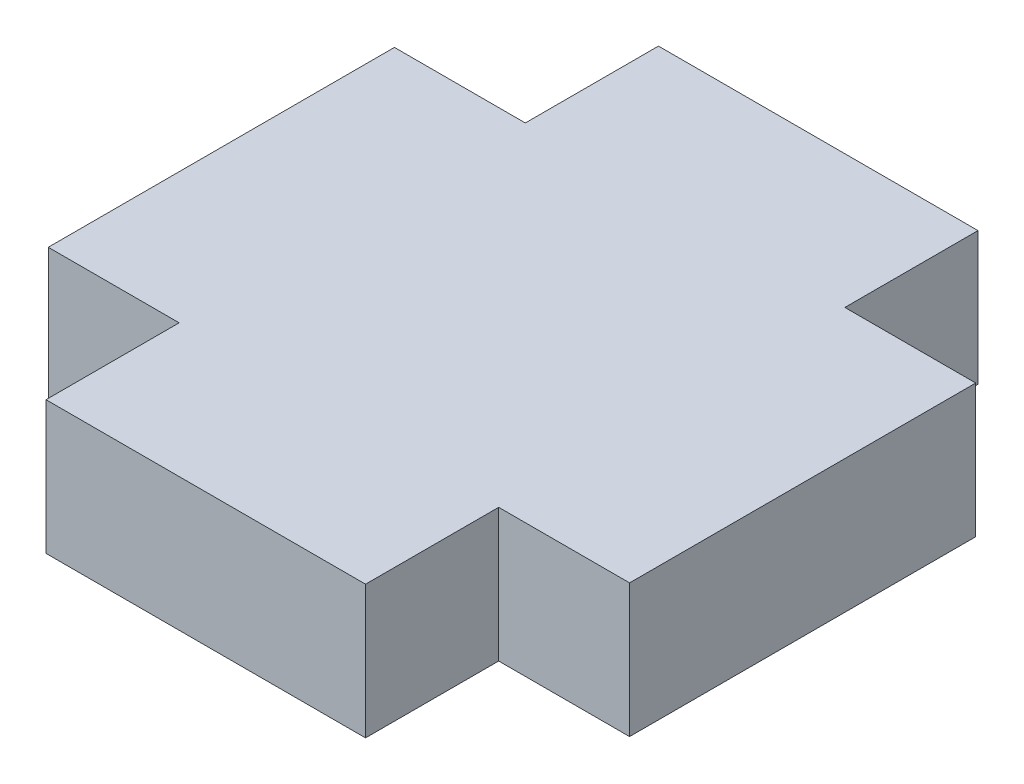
ISO-10303-21;
HEADER;
FILE_DESCRIPTION(('STEP AP214'),'2;1');
FILE_NAME('part.step','',(''),(''),'','','');
FILE_SCHEMA(('AUTOMOTIVE_DESIGN { 1 0 10303 214 1 1 1 1 }'));
ENDSEC;
DATA;
#1=APPLICATION_CONTEXT('core data for automotive mechanical design processes');
#2=APPLICATION_PROTOCOL_DEFINITION('international standard','automotive_design',2000,#1);
#3=PRODUCT_CONTEXT('',#1,'mechanical');
#4=PRODUCT('Part','Part','',(#3));
#5=PRODUCT_RELATED_PRODUCT_CATEGORY('part','',(#4));
#6=PRODUCT_DEFINITION_FORMATION('','',#4);
#7=PRODUCT_DEFINITION_CONTEXT('part definition',#1,'design');
#8=PRODUCT_DEFINITION('design','',#6,#7);
#9=PRODUCT_DEFINITION_SHAPE('','',#8);
#10=(LENGTH_UNIT() NAMED_UNIT(*) SI_UNIT(.MILLI.,.METRE.));
#11=(NAMED_UNIT(*) PLANE_ANGLE_UNIT() SI_UNIT($,.RADIAN.));
#12=(NAMED_UNIT(*) SI_UNIT($,.STERADIAN.) SOLID_ANGLE_UNIT());
#13=UNCERTAINTY_MEASURE_WITH_UNIT(LENGTH_MEASURE(1.E-05),#10,'distance_accuracy_value','');
#14=(GEOMETRIC_REPRESENTATION_CONTEXT(3) GLOBAL_UNCERTAINTY_ASSIGNED_CONTEXT((#13)) GLOBAL_UNIT_ASSIGNED_CONTEXT((#10,
#11,#12)) REPRESENTATION_CONTEXT('',''));
#15=CARTESIAN_POINT('',(0.,0.,0.));
#16=DIRECTION('',(0.,0.,1.));
#17=DIRECTION('',(1.,0.,0.));
#18=AXIS2_PLACEMENT_3D('',#15,#16,#17);
#19=CARTESIAN_POINT('',(-10.915,5.,-6.5));
#20=DIRECTION('',(0.,0.,1.));
#21=DIRECTION('',(1.,0.,0.));
#22=AXIS2_PLACEMENT_3D('',#19,#20,#21);
#23=PLANE('',#22);
#24=DIRECTION('',(-1.,0.,0.));
#25=VECTOR('',#24,1.);
#26=CARTESIAN_POINT('',(-10.915,0.,-6.5));
#27=LINE('',#26,#25);
#28=CARTESIAN_POINT('',(-6.,0.,-6.5));
#29=VERTEX_POINT('',#28);
#30=CARTESIAN_POINT('',(-10.915,0.,-6.5));
#31=VERTEX_POINT('',#30);
#32=EDGE_CURVE('E157',#29,#31,#27,.T.);
#33=ORIENTED_EDGE('',*,*,#32,.T.);
#34=DIRECTION('',(0.,-1.,0.));
#35=VECTOR('',#34,1.);
#36=CARTESIAN_POINT('',(-10.915,5.,-6.5));
#37=LINE('',#36,#35);
#38=CARTESIAN_POINT('',(-10.915,5.,-6.5));
#39=VERTEX_POINT('',#38);
#40=EDGE_CURVE('E11',#39,#31,#37,.T.);
#41=ORIENTED_EDGE('',*,*,#40,.F.);
#42=DIRECTION('',(-1.,0.,0.));
#43=VECTOR('',#42,1.);
#44=CARTESIAN_POINT('',(-10.915,5.,-6.5));
#45=LINE('',#44,#43);
#46=CARTESIAN_POINT('',(-6.,5.,-6.5));
#47=VERTEX_POINT('',#46);
#48=EDGE_CURVE('E179',#47,#39,#45,.T.);
#49=ORIENTED_EDGE('',*,*,#48,.F.);
#50=DIRECTION('',(0.,-1.,0.));
#51=VECTOR('',#50,1.);
#52=CARTESIAN_POINT('',(-6.,5.,-6.5));
#53=LINE('',#52,#51);
#54=EDGE_CURVE('E153',#47,#29,#53,.T.);
#55=ORIENTED_EDGE('',*,*,#54,.T.);
#56=EDGE_LOOP('',(#33,#41,#49,#55));
#57=FACE_BOUND('',#56,.T.);
#58=ADVANCED_FACE('F37',(#57),#23,.F.);
#59=CARTESIAN_POINT('',(-10.915,5.,-6.5));
#60=DIRECTION('',(1.,0.,0.));
#61=DIRECTION('',(0.,0.,-1.));
#62=AXIS2_PLACEMENT_3D('',#59,#60,#61);
#63=PLANE('',#62);
#64=DIRECTION('',(0.,0.,1.));
#65=VECTOR('',#64,1.);
#66=CARTESIAN_POINT('',(-10.915,0.,-6.5));
#67=LINE('',#66,#65);
#68=CARTESIAN_POINT('',(-10.915,0.,6.5));
#69=VERTEX_POINT('',#68);
#70=EDGE_CURVE('E160',#31,#69,#67,.T.);
#71=ORIENTED_EDGE('',*,*,#70,.T.);
#72=DIRECTION('',(0.,-1.,0.));
#73=VECTOR('',#72,1.);
#74=CARTESIAN_POINT('',(-10.915,5.,6.5));
#75=LINE('',#74,#73);
#76=CARTESIAN_POINT('',(-10.915,5.,6.5));
#77=VERTEX_POINT('',#76);
#78=EDGE_CURVE('E45',#77,#69,#75,.T.);
#79=ORIENTED_EDGE('',*,*,#78,.F.);
#80=DIRECTION('',(0.,0.,1.));
#81=VECTOR('',#80,1.);
#82=CARTESIAN_POINT('',(-10.915,5.,-6.5));
#83=LINE('',#82,#81);
#84=EDGE_CURVE('E108',#39,#77,#83,.T.);
#85=ORIENTED_EDGE('',*,*,#84,.F.);
#86=ORIENTED_EDGE('',*,*,#40,.T.);
#87=EDGE_LOOP('',(#71,#79,#85,#86));
#88=FACE_BOUND('',#87,.T.);
#89=ADVANCED_FACE('F257',(#88),#63,.F.);
#90=CARTESIAN_POINT('',(-10.915,5.,6.5));
#91=DIRECTION('',(0.,0.,-1.));
#92=DIRECTION('',(-1.,0.,0.));
#93=AXIS2_PLACEMENT_3D('',#90,#91,#92);
#94=PLANE('',#93);
#95=DIRECTION('',(1.,0.,0.));
#96=VECTOR('',#95,1.);
#97=CARTESIAN_POINT('',(-10.915,0.,6.5));
#98=LINE('',#97,#96);
#99=CARTESIAN_POINT('',(-6.,0.,6.5));
#100=VERTEX_POINT('',#99);
#101=EDGE_CURVE('E162',#69,#100,#98,.T.);
#102=ORIENTED_EDGE('',*,*,#101,.T.);
#103=DIRECTION('',(0.,-1.,0.));
#104=VECTOR('',#103,1.);
#105=CARTESIAN_POINT('',(-6.,5.,6.5));
#106=LINE('',#105,#104);
#107=CARTESIAN_POINT('',(-6.,5.,6.5));
#108=VERTEX_POINT('',#107);
#109=EDGE_CURVE('E198',#108,#100,#106,.T.);
#110=ORIENTED_EDGE('',*,*,#109,.F.);
#111=DIRECTION('',(1.,0.,0.));
#112=VECTOR('',#111,1.);
#113=CARTESIAN_POINT('',(-10.915,5.,6.5));
#114=LINE('',#113,#112);
#115=EDGE_CURVE('E206',#77,#108,#114,.T.);
#116=ORIENTED_EDGE('',*,*,#115,.F.);
#117=ORIENTED_EDGE('',*,*,#78,.T.);
#118=EDGE_LOOP('',(#102,#110,#116,#117));
#119=FACE_BOUND('',#118,.T.);
#120=ADVANCED_FACE('F204',(#119),#94,.F.);
#121=CARTESIAN_POINT('',(-6.,5.,6.5));
#122=DIRECTION('',(1.,0.,0.));
#123=DIRECTION('',(0.,0.,-1.));
#124=AXIS2_PLACEMENT_3D('',#121,#122,#123);
#125=PLANE('',#124);
#126=DIRECTION('',(0.,0.,1.));
#127=VECTOR('',#126,1.);
#128=CARTESIAN_POINT('',(-6.,0.,6.5));
#129=LINE('',#128,#127);
#130=CARTESIAN_POINT('',(-6.,0.,11.5));
#131=VERTEX_POINT('',#130);
#132=EDGE_CURVE('E164',#100,#131,#129,.T.);
#133=ORIENTED_EDGE('',*,*,#132,.T.);
#134=DIRECTION('',(0.,-1.,0.));
#135=VECTOR('',#134,1.);
#136=CARTESIAN_POINT('',(-6.,5.,11.5));
#137=LINE('',#136,#135);
#138=CARTESIAN_POINT('',(-6.,5.,11.5));
#139=VERTEX_POINT('',#138);
#140=EDGE_CURVE('E195',#139,#131,#137,.T.);
#141=ORIENTED_EDGE('',*,*,#140,.F.);
#142=DIRECTION('',(0.,0.,1.));
#143=VECTOR('',#142,1.);
#144=CARTESIAN_POINT('',(-6.,5.,6.5));
#145=LINE('',#144,#143);
#146=EDGE_CURVE('E224',#108,#139,#145,.T.);
#147=ORIENTED_EDGE('',*,*,#146,.F.);
#148=ORIENTED_EDGE('',*,*,#109,.T.);
#149=EDGE_LOOP('',(#133,#141,#147,#148));
#150=FACE_BOUND('',#149,.T.);
#151=ADVANCED_FACE('F215',(#150),#125,.F.);
#152=CARTESIAN_POINT('',(-6.,5.,11.5));
#153=DIRECTION('',(0.,0.,-1.));
#154=DIRECTION('',(-1.,0.,0.));
#155=AXIS2_PLACEMENT_3D('',#152,#153,#154);
#156=PLANE('',#155);
#157=DIRECTION('',(1.,0.,0.));
#158=VECTOR('',#157,1.);
#159=CARTESIAN_POINT('',(-6.,0.,11.5));
#160=LINE('',#159,#158);
#161=CARTESIAN_POINT('',(6.,0.,11.5));
#162=VERTEX_POINT('',#161);
#163=EDGE_CURVE('E166',#131,#162,#160,.T.);
#164=ORIENTED_EDGE('',*,*,#163,.T.);
#165=DIRECTION('',(0.,-1.,0.));
#166=VECTOR('',#165,1.);
#167=CARTESIAN_POINT('',(6.,5.,11.5));
#168=LINE('',#167,#166);
#169=CARTESIAN_POINT('',(6.,5.,11.5));
#170=VERTEX_POINT('',#169);
#171=EDGE_CURVE('E192',#170,#162,#168,.T.);
#172=ORIENTED_EDGE('',*,*,#171,.F.);
#173=DIRECTION('',(1.,0.,0.));
#174=VECTOR('',#173,1.);
#175=CARTESIAN_POINT('',(-6.,5.,11.5));
#176=LINE('',#175,#174);
#177=EDGE_CURVE('E221',#139,#170,#176,.T.);
#178=ORIENTED_EDGE('',*,*,#177,.F.);
#179=ORIENTED_EDGE('',*,*,#140,.T.);
#180=EDGE_LOOP('',(#164,#172,#178,#179));
#181=FACE_BOUND('',#180,.T.);
#182=ADVANCED_FACE('F219',(#181),#156,.F.);
#183=CARTESIAN_POINT('',(6.,5.,11.5));
#184=DIRECTION('',(-1.,0.,0.));
#185=DIRECTION('',(0.,0.,1.));
#186=AXIS2_PLACEMENT_3D('',#183,#184,#185);
#187=PLANE('',#186);
#188=DIRECTION('',(0.,0.,-1.));
#189=VECTOR('',#188,1.);
#190=CARTESIAN_POINT('',(6.,0.,11.5));
#191=LINE('',#190,#189);
#192=CARTESIAN_POINT('',(6.,0.,6.5));
#193=VERTEX_POINT('',#192);
#194=EDGE_CURVE('E168',#162,#193,#191,.T.);
#195=ORIENTED_EDGE('',*,*,#194,.T.);
#196=DIRECTION('',(0.,-1.,0.));
#197=VECTOR('',#196,1.);
#198=CARTESIAN_POINT('',(6.,5.,6.5));
#199=LINE('',#198,#197);
#200=CARTESIAN_POINT('',(6.,5.,6.5));
#201=VERTEX_POINT('',#200);
#202=EDGE_CURVE('E189',#201,#193,#199,.T.);
#203=ORIENTED_EDGE('',*,*,#202,.F.);
#204=DIRECTION('',(0.,0.,-1.));
#205=VECTOR('',#204,1.);
#206=CARTESIAN_POINT('',(6.,5.,11.5));
#207=LINE('',#206,#205);
#208=EDGE_CURVE('E223',#170,#201,#207,.T.);
#209=ORIENTED_EDGE('',*,*,#208,.F.);
#210=ORIENTED_EDGE('',*,*,#171,.T.);
#211=EDGE_LOOP('',(#195,#203,#209,#210));
#212=FACE_BOUND('',#211,.T.);
#213=ADVANCED_FACE('F270',(#212),#187,.F.);
#214=CARTESIAN_POINT('',(6.,5.,6.5));
#215=DIRECTION('',(0.,0.,-1.));
#216=DIRECTION('',(-1.,0.,0.));
#217=AXIS2_PLACEMENT_3D('',#214,#215,#216);
#218=PLANE('',#217);
#219=DIRECTION('',(1.,0.,0.));
#220=VECTOR('',#219,1.);
#221=CARTESIAN_POINT('',(6.,0.,6.5));
#222=LINE('',#221,#220);
#223=CARTESIAN_POINT('',(10.915,0.,6.5));
#224=VERTEX_POINT('',#223);
#225=EDGE_CURVE('E170',#193,#224,#222,.T.);
#226=ORIENTED_EDGE('',*,*,#225,.T.);
#227=DIRECTION('',(0.,-1.,0.));
#228=VECTOR('',#227,1.);
#229=CARTESIAN_POINT('',(10.915,5.,6.5));
#230=LINE('',#229,#228);
#231=CARTESIAN_POINT('',(10.915,5.,6.5));
#232=VERTEX_POINT('',#231);
#233=EDGE_CURVE('E186',#232,#224,#230,.T.);
#234=ORIENTED_EDGE('',*,*,#233,.F.);
#235=DIRECTION('',(1.,0.,0.));
#236=VECTOR('',#235,1.);
#237=CARTESIAN_POINT('',(6.,5.,6.5));
#238=LINE('',#237,#236);
#239=EDGE_CURVE('E226',#201,#232,#238,.T.);
#240=ORIENTED_EDGE('',*,*,#239,.F.);
#241=ORIENTED_EDGE('',*,*,#202,.T.);
#242=EDGE_LOOP('',(#226,#234,#240,#241));
#243=FACE_BOUND('',#242,.T.);
#244=ADVANCED_FACE('F273',(#243),#218,.F.);
#245=CARTESIAN_POINT('',(10.915,5.,-6.5));
#246=DIRECTION('',(-1.,0.,0.));
#247=DIRECTION('',(0.,0.,1.));
#248=AXIS2_PLACEMENT_3D('',#245,#246,#247);
#249=PLANE('',#248);
#250=DIRECTION('',(0.,0.,-1.));
#251=VECTOR('',#250,1.);
#252=CARTESIAN_POINT('',(10.915,0.,-6.5));
#253=LINE('',#252,#251);
#254=CARTESIAN_POINT('',(10.915,0.,-6.5));
#255=VERTEX_POINT('',#254);
#256=EDGE_CURVE('E172',#224,#255,#253,.T.);
#257=ORIENTED_EDGE('',*,*,#256,.T.);
#258=DIRECTION('',(0.,-1.,0.));
#259=VECTOR('',#258,1.);
#260=CARTESIAN_POINT('',(10.915,5.,-6.5));
#261=LINE('',#260,#259);
#262=CARTESIAN_POINT('',(10.915,5.,-6.5));
#263=VERTEX_POINT('',#262);
#264=EDGE_CURVE('E183',#263,#255,#261,.T.);
#265=ORIENTED_EDGE('',*,*,#264,.F.);
#266=DIRECTION('',(0.,0.,-1.));
#267=VECTOR('',#266,1.);
#268=CARTESIAN_POINT('',(10.915,5.,-6.5));
#269=LINE('',#268,#267);
#270=EDGE_CURVE('E232',#232,#263,#269,.T.);
#271=ORIENTED_EDGE('',*,*,#270,.F.);
#272=ORIENTED_EDGE('',*,*,#233,.T.);
#273=EDGE_LOOP('',(#257,#265,#271,#272));
#274=FACE_BOUND('',#273,.T.);
#275=ADVANCED_FACE('F238',(#274),#249,.F.);
#276=CARTESIAN_POINT('',(6.,5.,-6.5));
#277=DIRECTION('',(0.,0.,1.));
#278=DIRECTION('',(1.,0.,0.));
#279=AXIS2_PLACEMENT_3D('',#276,#277,#278);
#280=PLANE('',#279);
#281=DIRECTION('',(-1.,0.,0.));
#282=VECTOR('',#281,1.);
#283=CARTESIAN_POINT('',(6.,0.,-6.5));
#284=LINE('',#283,#282);
#285=CARTESIAN_POINT('',(6.,0.,-6.5));
#286=VERTEX_POINT('',#285);
#287=EDGE_CURVE('E174',#255,#286,#284,.T.);
#288=ORIENTED_EDGE('',*,*,#287,.T.);
#289=DIRECTION('',(0.,-1.,0.));
#290=VECTOR('',#289,1.);
#291=CARTESIAN_POINT('',(6.,5.,-6.5));
#292=LINE('',#291,#290);
#293=CARTESIAN_POINT('',(6.,5.,-6.5));
#294=VERTEX_POINT('',#293);
#295=EDGE_CURVE('E148',#294,#286,#292,.T.);
#296=ORIENTED_EDGE('',*,*,#295,.F.);
#297=DIRECTION('',(-1.,0.,0.));
#298=VECTOR('',#297,1.);
#299=CARTESIAN_POINT('',(6.,5.,-6.5));
#300=LINE('',#299,#298);
#301=EDGE_CURVE('E139',#263,#294,#300,.T.);
#302=ORIENTED_EDGE('',*,*,#301,.F.);
#303=ORIENTED_EDGE('',*,*,#264,.T.);
#304=EDGE_LOOP('',(#288,#296,#302,#303));
#305=FACE_BOUND('',#304,.T.);
#306=ADVANCED_FACE('F242',(#305),#280,.F.);
#307=CARTESIAN_POINT('',(6.,5.,-11.5));
#308=DIRECTION('',(-1.,0.,0.));
#309=DIRECTION('',(0.,0.,1.));
#310=AXIS2_PLACEMENT_3D('',#307,#308,#309);
#311=PLANE('',#310);
#312=DIRECTION('',(0.,0.,-1.));
#313=VECTOR('',#312,1.);
#314=CARTESIAN_POINT('',(6.,0.,-11.5));
#315=LINE('',#314,#313);
#316=CARTESIAN_POINT('',(6.,0.,-11.5));
#317=VERTEX_POINT('',#316);
#318=EDGE_CURVE('E147',#286,#317,#315,.T.);
#319=ORIENTED_EDGE('',*,*,#318,.T.);
#320=DIRECTION('',(0.,-1.,0.));
#321=VECTOR('',#320,1.);
#322=CARTESIAN_POINT('',(6.,5.,-11.5));
#323=LINE('',#322,#321);
#324=CARTESIAN_POINT('',(6.,5.,-11.5));
#325=VERTEX_POINT('',#324);
#326=EDGE_CURVE('E144',#325,#317,#323,.T.);
#327=ORIENTED_EDGE('',*,*,#326,.F.);
#328=DIRECTION('',(0.,0.,-1.));
#329=VECTOR('',#328,1.);
#330=CARTESIAN_POINT('',(6.,5.,-11.5));
#331=LINE('',#330,#329);
#332=EDGE_CURVE('E133',#294,#325,#331,.T.);
#333=ORIENTED_EDGE('',*,*,#332,.F.);
#334=ORIENTED_EDGE('',*,*,#295,.T.);
#335=EDGE_LOOP('',(#319,#327,#333,#334));
#336=FACE_BOUND('',#335,.T.);
#337=ADVANCED_FACE('F145',(#336),#311,.F.);
#338=CARTESIAN_POINT('',(-6.,5.,-11.5));
#339=DIRECTION('',(0.,0.,1.));
#340=DIRECTION('',(1.,0.,0.));
#341=AXIS2_PLACEMENT_3D('',#338,#339,#340);
#342=PLANE('',#341);
#343=DIRECTION('',(-1.,0.,0.));
#344=VECTOR('',#343,1.);
#345=CARTESIAN_POINT('',(-6.,0.,-11.5));
#346=LINE('',#345,#344);
#347=CARTESIAN_POINT('',(-6.,0.,-11.5));
#348=VERTEX_POINT('',#347);
#349=EDGE_CURVE('E94',#317,#348,#346,.T.);
#350=ORIENTED_EDGE('',*,*,#349,.T.);
#351=DIRECTION('',(0.,-1.,0.));
#352=VECTOR('',#351,1.);
#353=CARTESIAN_POINT('',(-6.,5.,-11.5));
#354=LINE('',#353,#352);
#355=CARTESIAN_POINT('',(-6.,5.,-11.5));
#356=VERTEX_POINT('',#355);
#357=EDGE_CURVE('E149',#356,#348,#354,.T.);
#358=ORIENTED_EDGE('',*,*,#357,.F.);
#359=DIRECTION('',(-1.,0.,0.));
#360=VECTOR('',#359,1.);
#361=CARTESIAN_POINT('',(-6.,5.,-11.5));
#362=LINE('',#361,#360);
#363=EDGE_CURVE('E137',#325,#356,#362,.T.);
#364=ORIENTED_EDGE('',*,*,#363,.F.);
#365=ORIENTED_EDGE('',*,*,#326,.T.);
#366=EDGE_LOOP('',(#350,#358,#364,#365));
#367=FACE_BOUND('',#366,.T.);
#368=ADVANCED_FACE('F151',(#367),#342,.F.);
#369=CARTESIAN_POINT('',(-6.,5.,-6.5));
#370=DIRECTION('',(1.,0.,0.));
#371=DIRECTION('',(0.,0.,-1.));
#372=AXIS2_PLACEMENT_3D('',#369,#370,#371);
#373=PLANE('',#372);
#374=DIRECTION('',(0.,0.,1.));
#375=VECTOR('',#374,1.);
#376=CARTESIAN_POINT('',(-6.,0.,-6.5));
#377=LINE('',#376,#375);
#378=EDGE_CURVE('E100',#348,#29,#377,.T.);
#379=ORIENTED_EDGE('',*,*,#378,.T.);
#380=ORIENTED_EDGE('',*,*,#54,.F.);
#381=DIRECTION('',(0.,0.,1.));
#382=VECTOR('',#381,1.);
#383=CARTESIAN_POINT('',(-6.,5.,-6.5));
#384=LINE('',#383,#382);
#385=EDGE_CURVE('E53',#356,#47,#384,.T.);
#386=ORIENTED_EDGE('',*,*,#385,.F.);
#387=ORIENTED_EDGE('',*,*,#357,.T.);
#388=EDGE_LOOP('',(#379,#380,#386,#387));
#389=FACE_BOUND('',#388,.T.);
#390=ADVANCED_FACE('F246',(#389),#373,.F.);
#391=CARTESIAN_POINT('',(0.,5.,0.));
#392=DIRECTION('',(0.,1.,0.));
#393=DIRECTION('',(0.,0.,1.));
#394=AXIS2_PLACEMENT_3D('',#391,#392,#393);
#395=PLANE('',#394);
#396=ORIENTED_EDGE('',*,*,#48,.T.);
#397=ORIENTED_EDGE('',*,*,#84,.T.);
#398=ORIENTED_EDGE('',*,*,#115,.T.);
#399=ORIENTED_EDGE('',*,*,#146,.T.);
#400=ORIENTED_EDGE('',*,*,#177,.T.);
#401=ORIENTED_EDGE('',*,*,#208,.T.);
#402=ORIENTED_EDGE('',*,*,#239,.T.);
#403=ORIENTED_EDGE('',*,*,#270,.T.);
#404=ORIENTED_EDGE('',*,*,#301,.T.);
#405=ORIENTED_EDGE('',*,*,#332,.T.);
#406=ORIENTED_EDGE('',*,*,#363,.T.);
#407=ORIENTED_EDGE('',*,*,#385,.T.);
#408=EDGE_LOOP('',(#396,#397,#398,#399,#400,#401,#402,#403,#404,#405,#406,#407));
#409=FACE_BOUND('',#408,.T.);
#410=ADVANCED_FACE('F135',(#409),#395,.T.);
#411=CARTESIAN_POINT('',(0.,0.,0.));
#412=DIRECTION('',(0.,1.,0.));
#413=DIRECTION('',(0.,0.,1.));
#414=AXIS2_PLACEMENT_3D('',#411,#412,#413);
#415=PLANE('',#414);
#416=ORIENTED_EDGE('',*,*,#32,.F.);
#417=ORIENTED_EDGE('',*,*,#378,.F.);
#418=ORIENTED_EDGE('',*,*,#349,.F.);
#419=ORIENTED_EDGE('',*,*,#318,.F.);
#420=ORIENTED_EDGE('',*,*,#287,.F.);
#421=ORIENTED_EDGE('',*,*,#256,.F.);
#422=ORIENTED_EDGE('',*,*,#225,.F.);
#423=ORIENTED_EDGE('',*,*,#194,.F.);
#424=ORIENTED_EDGE('',*,*,#163,.F.);
#425=ORIENTED_EDGE('',*,*,#132,.F.);
#426=ORIENTED_EDGE('',*,*,#101,.F.);
#427=ORIENTED_EDGE('',*,*,#70,.F.);
#428=EDGE_LOOP('',(#416,#417,#418,#419,#420,#421,#422,#423,#424,#425,#426,#427));
#429=FACE_BOUND('',#428,.T.);
#430=ADVANCED_FACE('F210',(#429),#415,.F.);
#431=CLOSED_SHELL('',(#58,#89,#120,#151,#182,#213,#244,#275,#306,#337,#368,#390,#410,#430));
#432=MANIFOLD_SOLID_BREP('B2',#431);
#433=ADVANCED_BREP_SHAPE_REPRESENTATION('',(#18,#432),#14);
#434=SHAPE_DEFINITION_REPRESENTATION(#9,#433);
ENDSEC;
END-ISO-10303-21;
